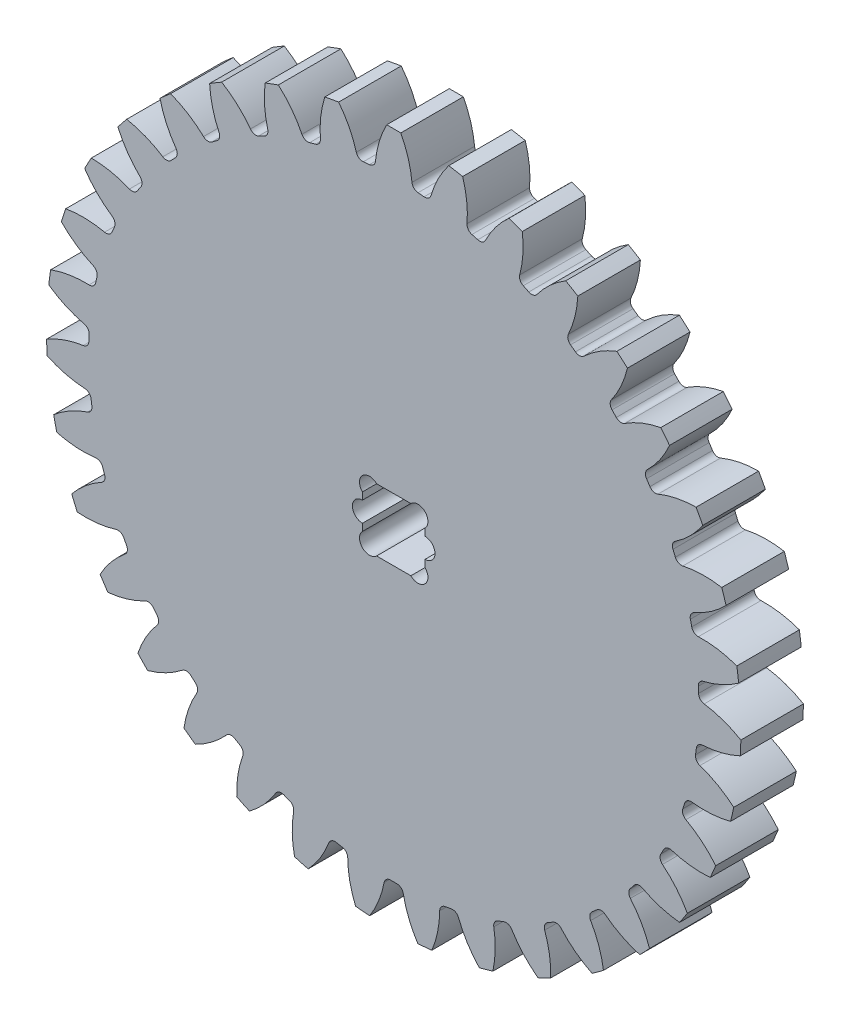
from build123d import *

# Parameters (mm, degrees)
BOSS_EXTRU_1_DEPTH                 = 10
CONG_1_R                           = 1.05
R_P_TITION_CIRCULAIRE4_COUNT       = 35
CONG_1_OF_R_P_TITION_CIRCULAIRE4_R = 1.05
ENL_V_MAT_EXTRU_1_DEPTH            = 81.380637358
ESQUISSE6_R                        = 1.6
ENL_V_MAT_EXTRU_2_DEPTH            = 8


with BuildPart() as part:
    # Esquisse3 → Boss.-Extru.1 (new body)
    with BuildSketch(Plane.XY):
        with BuildLine():
            Line((-5.748623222, 47.993394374), (-1.378706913, -0.560352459))
            Line((-1.378706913, -0.560352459), (2.991209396, 47.993394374))
            ThreePointArc((2.991209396, 47.993394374), (2.29942307, 48.050694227), (1.606890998, 48.098138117))
            ThreePointArc((1.606890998, 48.098138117), (1.053069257, 51.615611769), (-0.253030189, 54.928230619))
            ThreePointArc((-0.253030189, 54.928230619), (-1.378706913, 54.939647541), (-2.504383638, 54.928230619))
            ThreePointArc((-2.504383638, 54.928230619), (-3.810483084, 51.615611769), (-4.364304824, 48.098138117))
            ThreePointArc((-4.364304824, 48.098138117), (-5.056836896, 48.050694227), (-5.748623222, 47.993394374))
        make_face()
    boss_extru_1 = extrude(amount=BOSS_EXTRU_1_DEPTH)

    # Cong_1
    cong_1_edges = [part.edges().sort_by_distance(p)[0] for p in [
        (-4.364304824, 48.098138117, 5),
        (1.606890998, 48.098138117, 5),
    ]]
    fillet(cong_1_edges, radius=CONG_1_R)

    # R_p_tition circulaire4: Boss.-Extru.1 ×35 about axis
    r_p_tition_circulaire4_axis = Axis((-1.378706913, -0.560352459, 0), (0, 0, 1))
    for i in range(1, R_P_TITION_CIRCULAIRE4_COUNT):
        add(boss_extru_1.rotate(r_p_tition_circulaire4_axis, i * 360 / R_P_TITION_CIRCULAIRE4_COUNT))

    # Cong_1 of R_p_tition circulaire4
    cong_1_of_r_p_tition_circulaire4_edges = [part.edges().sort_by_distance(p)[0] for p in [
        (-13.00463402, 46.783077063, 5),
        (-7.129397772, 47.849275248, 5),
        (-21.271296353, 43.94635923, 5),
        (-15.680854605, 46.044487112, 5),
        (-28.898594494, 39.679159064, 5),
        (-23.772628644, 42.741781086, 5),
        (-35.641380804, 34.118627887, 5),
        (-31.144643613, 38.047308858, 5),
        (-41.282936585, 27.443485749, 5),
        (-37.559956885, 32.11195463, 5),
        (-45.64193759, 19.868277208, 5),
        (-42.812375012, 25.126485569, 5),
        (-48.578281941, 11.636475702, 5),
        (-46.733080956, 17.315420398, 5),
        (-49.997593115, 3.012658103, 5),
        (-49.196059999, 8.92981318, 5),
        (-49.854253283, -5.725998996, 5),
        (-50.122149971, 0.239184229, 5),
        (-48.152869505, -14.298627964, 5),
        (-49.481585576, -8.477142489, 5),
        (-44.948125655, -22.429697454, 5),
        (-47.294955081, -16.939017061, 5),
        (-40.343024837, -29.857868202, 5),
        (-43.632538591, -24.874467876, 5),
        (-34.485578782, -36.344392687, 5),
        (-38.612049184, -32.028443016, 5),
        (-27.564050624, -41.680788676, 5),
        (-32.394849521, -38.171007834, 5),
        (-19.800903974, -45.695540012, 5),
        (-25.180765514, -43.104735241, 5),
        (-11.445652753, -48.259609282, 5),
        (-17.201663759, -46.671051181, 5),
        (-2.766841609, -49.29058519, 5),
        (-8.713999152, -48.755331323, 5),
        (5.956585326, -48.755331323, 5),
        (0.009427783, -49.29058519, 5),
        (14.444249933, -46.671051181, 5),
        (8.688238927, -48.259609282, 5),
        (22.423351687, -43.104735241, 5),
        (17.043490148, -45.695540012, 5),
        (29.637435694, -38.171007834, 5),
        (24.806636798, -41.680788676, 5),
        (35.854635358, -32.028443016, 5),
        (31.728164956, -36.344392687, 5),
        (40.875124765, -24.874467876, 5),
        (37.585611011, -29.857868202, 5),
        (44.537541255, -16.939017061, 5),
        (42.190711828, -22.429697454, 5),
        (46.724171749, -8.477142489, 5),
        (45.395455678, -14.298627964, 5),
        (47.364736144, 0.239184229, 5),
        (47.096839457, -5.725998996, 5),
        (46.438646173, 8.92981318, 5),
        (47.240179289, 3.012658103, 5),
        (43.975667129, 17.315420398, 5),
        (45.820868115, 11.636475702, 5),
        (40.054961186, 25.126485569, 5),
        (42.884523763, 19.868277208, 5),
        (34.802543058, 32.11195463, 5),
        (38.525522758, 27.443485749, 5),
        (28.387229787, 38.047308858, 5),
        (32.883966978, 34.118627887, 5),
        (21.015214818, 42.741781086, 5),
        (26.141180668, 39.679159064, 5),
        (12.923440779, 46.044487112, 5),
        (18.513882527, 43.94635923, 5),
        (4.371983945, 47.849275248, 5),
        (10.247220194, 46.783077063, 5),
    ]]
    fillet(cong_1_of_r_p_tition_circulaire4_edges, radius=CONG_1_OF_R_P_TITION_CIRCULAIRE4_R)

    # Esquisse5 → Enl_v. mat.-Extru.1 (cut, through all)
    with BuildSketch(Plane.XY.offset(10)):
        with BuildLine():
            Line((-4.115965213, 4.439647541), (1.358551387, 4.439647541))
            ThreePointArc((1.358551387, 4.439647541), (3.621293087, 4.439647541), (3.621293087, 2.176905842))
            Line((3.621293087, 2.176905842), (3.621293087, -3.297610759))
            ThreePointArc((3.621293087, -3.297610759), (3.621293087, -5.560352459), (1.358551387, -5.560352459))
            Line((1.358551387, -5.560352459), (-4.115965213, -5.560352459))
            ThreePointArc((-4.115965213, -5.560352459), (-6.378706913, -5.560352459), (-6.378706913, -3.297610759))
            Line((-6.378706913, -3.297610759), (-6.378706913, 2.176905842))
            ThreePointArc((-6.378706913, 2.176905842), (-6.378706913, 4.439647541), (-4.115965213, 4.439647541))
        make_face()
    extrude(amount=-ENL_V_MAT_EXTRU_1_DEPTH, mode=Mode.SUBTRACT)

    # Esquisse6 → Enl_v. mat.-Extru.2 (cut)
    with BuildSketch(Plane.XY.offset(10)):
        with Locations((-6.378706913, -0.560352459)):
            Circle(ESQUISSE6_R)
        with Locations((3.621293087, -0.560352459)):
            Circle(ESQUISSE6_R)
    extrude(amount=-ENL_V_MAT_EXTRU_2_DEPTH, mode=Mode.SUBTRACT)


solid = part.part
